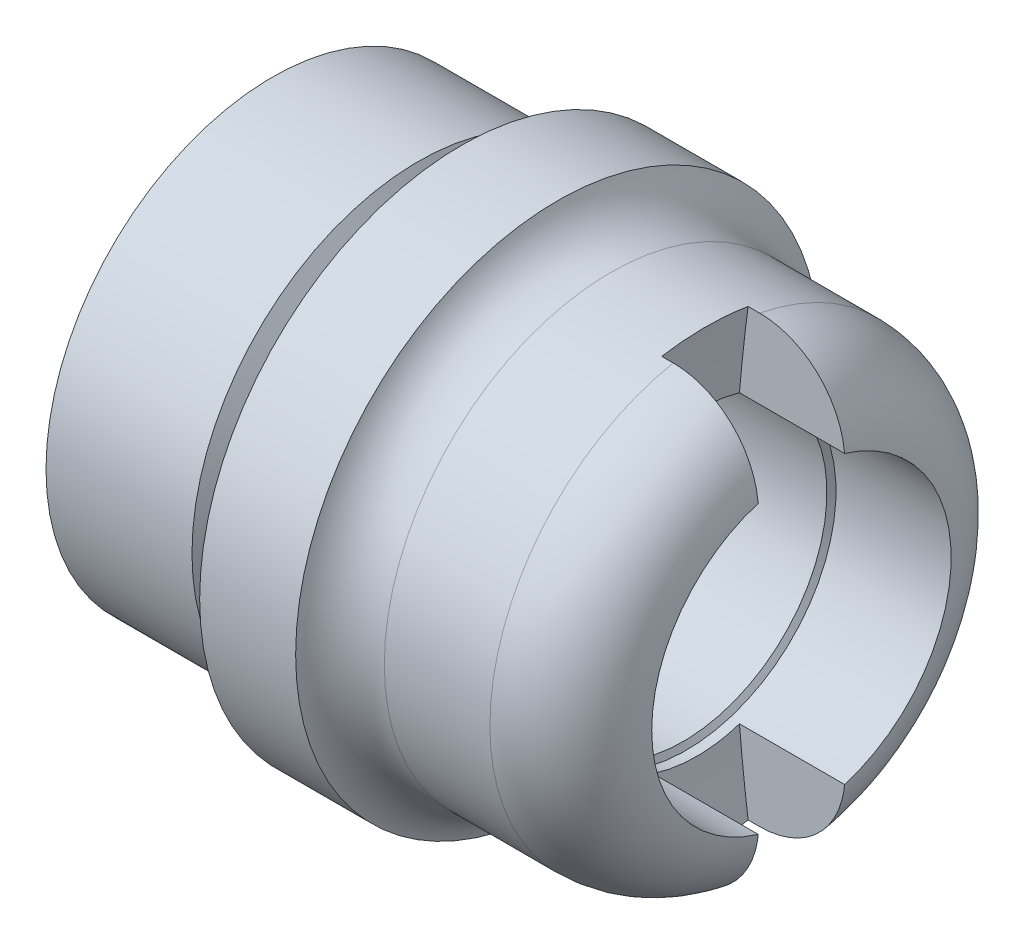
ISO-10303-21;
HEADER;
FILE_DESCRIPTION(('STEP AP214'),'2;1');
FILE_NAME('part.step','',(''),(''),'','','');
FILE_SCHEMA(('AUTOMOTIVE_DESIGN { 1 0 10303 214 1 1 1 1 }'));
ENDSEC;
DATA;
#1=APPLICATION_CONTEXT('core data for automotive mechanical design processes');
#2=APPLICATION_PROTOCOL_DEFINITION('international standard','automotive_design',2000,#1);
#3=PRODUCT_CONTEXT('',#1,'mechanical');
#4=PRODUCT('Part','Part','',(#3));
#5=PRODUCT_RELATED_PRODUCT_CATEGORY('part','',(#4));
#6=PRODUCT_DEFINITION_FORMATION('','',#4);
#7=PRODUCT_DEFINITION_CONTEXT('part definition',#1,'design');
#8=PRODUCT_DEFINITION('design','',#6,#7);
#9=PRODUCT_DEFINITION_SHAPE('','',#8);
#10=(LENGTH_UNIT() NAMED_UNIT(*) SI_UNIT(.MILLI.,.METRE.));
#11=(NAMED_UNIT(*) PLANE_ANGLE_UNIT() SI_UNIT($,.RADIAN.));
#12=(NAMED_UNIT(*) SI_UNIT($,.STERADIAN.) SOLID_ANGLE_UNIT());
#13=UNCERTAINTY_MEASURE_WITH_UNIT(LENGTH_MEASURE(1.E-05),#10,'distance_accuracy_value','');
#14=(GEOMETRIC_REPRESENTATION_CONTEXT(3) GLOBAL_UNCERTAINTY_ASSIGNED_CONTEXT((#13)) GLOBAL_UNIT_ASSIGNED_CONTEXT((#10,
#11,#12)) REPRESENTATION_CONTEXT('',''));
#15=CARTESIAN_POINT('',(0.,0.,0.));
#16=DIRECTION('',(0.,0.,1.));
#17=DIRECTION('',(1.,0.,0.));
#18=AXIS2_PLACEMENT_3D('',#15,#16,#17);
#19=CARTESIAN_POINT('',(5.96158464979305,0.,0.));
#20=DIRECTION('',(-1.,0.,0.));
#21=DIRECTION('',(0.,0.,1.));
#22=AXIS2_PLACEMENT_3D('',#19,#20,#21);
#23=TOROIDAL_SURFACE('',#22,1.86633605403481,1.13086394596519);
#24=CARTESIAN_POINT('',(5.96158464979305,0.,0.));
#25=DIRECTION('',(-1.,0.,0.));
#26=DIRECTION('',(0.,0.,1.));
#27=AXIS2_PLACEMENT_3D('',#24,#25,#26);
#28=CIRCLE('',#27,2.9972);
#29=CARTESIAN_POINT('',(5.96158464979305,-2.94220930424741,0.5715));
#30=VERTEX_POINT('',#29);
#31=CARTESIAN_POINT('',(5.96158464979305,2.94220930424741,0.5715));
#32=VERTEX_POINT('',#31);
#33=EDGE_CURVE('E225',#30,#32,#28,.T.);
#34=ORIENTED_EDGE('',*,*,#33,.F.);
#35=CARTESIAN_POINT('',(6.60490730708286,-2.73736211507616,0.5715));
#36=CARTESIAN_POINT('',(6.65740369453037,-2.70026409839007,0.5715));
#37=CARTESIAN_POINT('',(6.70673498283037,-2.65864123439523,0.5715));
#38=CARTESIAN_POINT('',(6.79766661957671,-2.56763470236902,0.5715));
#39=CARTESIAN_POINT('',(6.83926126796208,-2.51824536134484,0.5715));
#40=CARTESIAN_POINT('',(6.91356117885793,-2.41328029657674,0.5715));
#41=CARTESIAN_POINT('',(6.94627768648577,-2.35771252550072,0.5715));
#42=CARTESIAN_POINT('',(7.00212309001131,-2.24197316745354,0.5715));
#43=CARTESIAN_POINT('',(7.02525311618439,-2.18180212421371,0.5715));
#44=CARTESIAN_POINT('',(7.06188518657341,-2.05723977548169,0.5715));
#45=CARTESIAN_POINT('',(7.07517652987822,-1.99278665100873,0.5715));
#46=CARTESIAN_POINT('',(7.09123638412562,-1.86258858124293,0.5715));
#47=CARTESIAN_POINT('',(7.09400273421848,-1.79684337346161,0.5715));
#48=CARTESIAN_POINT('',(7.08914140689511,-1.66283217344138,0.5715));
#49=CARTESIAN_POINT('',(7.08104835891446,-1.59458337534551,0.5715));
#50=CARTESIAN_POINT('',(7.05425622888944,-1.46022455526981,0.5715));
#51=CARTESIAN_POINT('',(7.03555620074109,-1.39411472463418,0.5715));
#52=CARTESIAN_POINT('',(6.98683259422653,-1.26114709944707,0.5715));
#53=CARTESIAN_POINT('',(6.95613210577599,-1.19453796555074,0.5715));
#54=CARTESIAN_POINT('',(6.88486315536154,-1.06678061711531,0.5715));
#55=CARTESIAN_POINT('',(6.84428512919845,-1.00563777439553,0.5715));
#56=CARTESIAN_POINT('',(6.75049434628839,-0.88481966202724,0.5715));
#57=CARTESIAN_POINT('',(6.69647249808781,-0.825773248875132,0.5715));
#58=CARTESIAN_POINT('',(6.57955646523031,-0.717140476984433,0.5715));
#59=CARTESIAN_POINT('',(6.51666494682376,-0.667551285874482,0.5715));
#60=CARTESIAN_POINT('',(6.40625483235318,-0.595921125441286,0.5715));
#61=CARTESIAN_POINT('',(6.3610459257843,-0.570309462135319,0.5715));
#62=CARTESIAN_POINT('',(6.2674060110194,-0.525922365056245,0.5715));
#63=CARTESIAN_POINT('',(6.21898324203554,-0.507130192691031,0.5715));
#64=CARTESIAN_POINT('',(6.12894548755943,-0.48139288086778,0.5715));
#65=CARTESIAN_POINT('',(6.08779161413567,-0.472872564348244,0.5715));
#66=CARTESIAN_POINT('',(6.00465787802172,-0.463039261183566,0.5715));
#67=CARTESIAN_POINT('',(5.96267953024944,-0.461714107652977,0.5715));
#68=CARTESIAN_POINT('',(5.87919837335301,-0.46647186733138,0.5715));
#69=CARTESIAN_POINT('',(5.83769521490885,-0.472548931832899,0.5715));
#70=CARTESIAN_POINT('',(5.75612309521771,-0.491159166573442,0.5715));
#71=CARTESIAN_POINT('',(5.71605790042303,-0.503708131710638,0.5715));
#72=CARTESIAN_POINT('',(5.61756424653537,-0.541793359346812,0.5715));
#73=CARTESIAN_POINT('',(5.56044924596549,-0.570689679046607,0.5715));
#74=CARTESIAN_POINT('',(5.45129481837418,-0.636860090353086,0.5715));
#75=CARTESIAN_POINT('',(5.39926920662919,-0.674156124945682,0.5715));
#76=CARTESIAN_POINT('',(5.2862639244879,-0.76719844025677,0.5715));
#77=CARTESIAN_POINT('',(5.22709213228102,-0.825154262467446,0.5715));
#78=CARTESIAN_POINT('',(5.11919190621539,-0.949991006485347,0.5715));
#79=CARTESIAN_POINT('',(5.07045687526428,-1.01686624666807,0.5715));
#80=CARTESIAN_POINT('',(4.98510208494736,-1.15803538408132,0.5715));
#81=CARTESIAN_POINT('',(4.94848714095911,-1.23233221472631,0.5715));
#82=CARTESIAN_POINT('',(4.88924720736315,-1.38633062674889,0.5715));
#83=CARTESIAN_POINT('',(4.86661662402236,-1.46603003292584,0.5715));
#84=CARTESIAN_POINT('',(4.83782303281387,-1.62300880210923,0.5715));
#85=CARTESIAN_POINT('',(4.83068447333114,-1.70010828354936,0.5715));
#86=CARTESIAN_POINT('',(4.83075715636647,-1.85431150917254,0.5715));
#87=CARTESIAN_POINT('',(4.83796153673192,-1.93141523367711,0.5715));
#88=CARTESIAN_POINT('',(4.86566735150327,-2.07630043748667,0.5715));
#89=CARTESIAN_POINT('',(4.88496858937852,-2.14431245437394,0.5715));
#90=CARTESIAN_POINT('',(4.93539444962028,-2.27580431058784,0.5715));
#91=CARTESIAN_POINT('',(4.96651457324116,-2.33928586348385,0.5715));
#92=CARTESIAN_POINT('',(5.03769971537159,-2.45614611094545,0.5715));
#93=CARTESIAN_POINT('',(5.0771621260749,-2.50989246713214,0.5715));
#94=CARTESIAN_POINT('',(5.16483343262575,-2.60970481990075,0.5715));
#95=CARTESIAN_POINT('',(5.21304050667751,-2.65577241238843,0.5715));
#96=CARTESIAN_POINT('',(5.31507893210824,-2.73734804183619,0.5715));
#97=CARTESIAN_POINT('',(5.36867167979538,-2.77315480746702,0.5715));
#98=CARTESIAN_POINT('',(5.48119566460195,-2.83506407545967,0.5715));
#99=CARTESIAN_POINT('',(5.54012619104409,-2.86116786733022,0.5715));
#100=CARTESIAN_POINT('',(5.66047325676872,-2.90246178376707,0.5715));
#101=CARTESIAN_POINT('',(5.72182369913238,-2.91784474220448,0.5715));
#102=CARTESIAN_POINT('',(5.84625145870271,-2.93799804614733,0.5715));
#103=CARTESIAN_POINT('',(5.90932888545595,-2.94276771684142,0.5715));
#104=CARTESIAN_POINT('',(6.03486569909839,-2.94155138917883,0.5715));
#105=CARTESIAN_POINT('',(6.09732596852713,-2.93565180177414,0.5715));
#106=CARTESIAN_POINT('',(6.22033852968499,-2.91344488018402,0.5715));
#107=CARTESIAN_POINT('',(6.2808920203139,-2.89714422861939,0.5715));
#108=CARTESIAN_POINT('',(6.38668885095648,-2.85888720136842,0.5715));
#109=CARTESIAN_POINT('',(6.43258168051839,-2.83870080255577,0.5715));
#110=CARTESIAN_POINT('',(6.52125816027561,-2.79237773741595,0.5715));
#111=CARTESIAN_POINT('',(6.56404172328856,-2.76624090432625,0.5715));
#112=CARTESIAN_POINT('',(6.60490730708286,-2.73736211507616,0.5715));
#113=B_SPLINE_CURVE_WITH_KNOTS('',3,(#35,#36,#37,#38,#39,#40,#41,#42,#43,#44,#45,#46,#47,#48,
#49,#50,#51,#52,#53,#54,#55,#56,#57,#58,#59,#60,#61,#62,#63,#64,#65,#66,#67,#68,#69,#70,#71,#72,
#73,#74,#75,#76,#77,#78,#79,#80,#81,#82,#83,#84,#85,#86,#87,#88,#89,#90,#91,#92,#93,#94,#95,#96,
#97,#98,#99,#100,#101,#102,#103,#104,#105,#106,#107,#108,#109,#110,#111,#112),.UNSPECIFIED.,.T.,
.F.,(4,2,2,2,2,2,2,2,2,2,2,2,2,2,2,2,2,2,2,2,2,2,2,2,2,2,2,2,2,2,2,2,2,2,2,2,2,2,4),(0.,
0.192660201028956,0.385461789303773,0.578018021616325,0.770551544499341,0.967097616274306,
1.16368403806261,1.36896974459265,1.57427376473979,1.79338385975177,2.01270696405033,
2.25179582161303,2.49081296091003,2.64629100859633,2.8013848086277,2.92692364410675,
3.05225012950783,3.17747765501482,3.30301225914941,3.49397927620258,3.68545107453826,
3.93271228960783,4.17981674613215,4.42701926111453,4.67412283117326,4.9051505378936,
5.13606773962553,5.34707259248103,5.55799720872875,5.75704051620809,5.95604240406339,
6.14846582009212,6.34086365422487,6.52970473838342,6.71855782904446,6.90588823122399,
7.09309839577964,7.2430696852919,7.39304517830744),.UNSPECIFIED.);
#114=CARTESIAN_POINT('',(7.0866,-1.8969821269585,0.5715));
#115=VERTEX_POINT('',#114);
#116=EDGE_CURVE('E59',#30,#115,#113,.T.);
#117=ORIENTED_EDGE('',*,*,#116,.T.);
#118=CARTESIAN_POINT('',(7.0866,0.,0.));
#119=DIRECTION('',(-1.,0.,0.));
#120=DIRECTION('',(0.,0.,1.));
#121=AXIS2_PLACEMENT_3D('',#118,#119,#120);
#122=CIRCLE('',#121,1.9812);
#123=CARTESIAN_POINT('',(7.0866,1.8969821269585,0.5715));
#124=VERTEX_POINT('',#123);
#125=EDGE_CURVE('E218',#115,#124,#122,.T.);
#126=ORIENTED_EDGE('',*,*,#125,.T.);
#127=CARTESIAN_POINT('',(6.05835311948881,0.469494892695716,0.5715));
#128=CARTESIAN_POINT('',(6.11595320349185,0.477301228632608,0.5715));
#129=CARTESIAN_POINT('',(6.17266652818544,0.491970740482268,0.5715));
#130=CARTESIAN_POINT('',(6.28244565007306,0.531698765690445,0.5715));
#131=CARTESIAN_POINT('',(6.33548589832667,0.556822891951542,0.5715));
#132=CARTESIAN_POINT('',(6.45201686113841,0.622825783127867,0.5715));
#133=CARTESIAN_POINT('',(6.5141018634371,0.666158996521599,0.5715));
#134=CARTESIAN_POINT('',(6.6305811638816,0.761922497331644,0.5715));
#135=CARTESIAN_POINT('',(6.68498150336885,0.814345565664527,0.5715));
#136=CARTESIAN_POINT('',(6.78665840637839,0.928409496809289,0.5715));
#137=CARTESIAN_POINT('',(6.8336917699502,0.990268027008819,0.5715));
#138=CARTESIAN_POINT('',(6.91727698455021,1.1206957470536,0.5715));
#139=CARTESIAN_POINT('',(6.95383216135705,1.18926279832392,0.5715));
#140=CARTESIAN_POINT('',(7.01650646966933,1.33518359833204,0.5715));
#141=CARTESIAN_POINT('',(7.04200726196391,1.41280595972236,0.5715));
#142=CARTESIAN_POINT('',(7.07821599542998,1.57146670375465,0.5715));
#143=CARTESIAN_POINT('',(7.08892642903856,1.65250450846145,0.5715));
#144=CARTESIAN_POINT('',(7.09425521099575,1.80795149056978,0.5715));
#145=CARTESIAN_POINT('',(7.09020931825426,1.882315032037,0.5715));
#146=CARTESIAN_POINT('',(7.0686371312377,2.02905901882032,0.5715));
#147=CARTESIAN_POINT('',(7.05111833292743,2.10144054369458,0.5715));
#148=CARTESIAN_POINT('',(7.0046815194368,2.23638264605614,0.5715));
#149=CARTESIAN_POINT('',(6.97671793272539,2.2992725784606,0.5715));
#150=CARTESIAN_POINT('',(6.91013760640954,2.41913879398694,0.5715));
#151=CARTESIAN_POINT('',(6.87152387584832,2.47611674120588,0.5715));
#152=CARTESIAN_POINT('',(6.78672036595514,2.57980566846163,0.5715));
#153=CARTESIAN_POINT('',(6.74095926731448,2.62686767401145,0.5715));
#154=CARTESIAN_POINT('',(6.64199684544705,2.71238293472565,0.5715));
#155=CARTESIAN_POINT('',(6.58879678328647,2.7508376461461,0.5715));
#156=CARTESIAN_POINT('',(6.47800872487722,2.8170090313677,0.5715));
#157=CARTESIAN_POINT('',(6.42057458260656,2.84498351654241,0.5715));
#158=CARTESIAN_POINT('',(6.30177910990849,2.89073568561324,0.5715));
#159=CARTESIAN_POINT('',(6.24041813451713,2.90851428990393,0.5715));
#160=CARTESIAN_POINT('',(6.1164422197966,2.93314438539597,0.5715));
#161=CARTESIAN_POINT('',(6.05385711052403,2.94014623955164,0.5715));
#162=CARTESIAN_POINT('',(5.92840403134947,2.94348586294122,0.5715));
#163=CARTESIAN_POINT('',(5.86553607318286,2.93982407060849,0.5715));
#164=CARTESIAN_POINT('',(5.74162860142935,2.9219937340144,0.5715));
#165=CARTESIAN_POINT('',(5.68058157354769,2.90787732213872,0.5715));
#166=CARTESIAN_POINT('',(5.56171403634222,2.8696252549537,0.5715));
#167=CARTESIAN_POINT('',(5.50389351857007,2.84548962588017,0.5715));
#168=CARTESIAN_POINT('',(5.39291791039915,2.78783584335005,0.5715));
#169=CARTESIAN_POINT('',(5.33977739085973,2.7542896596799,0.5715));
#170=CARTESIAN_POINT('',(5.23980367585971,2.6788453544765,0.5715));
#171=CARTESIAN_POINT('',(5.19297068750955,2.63694695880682,0.5715));
#172=CARTESIAN_POINT('',(5.10634343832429,2.54550407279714,0.5715));
#173=CARTESIAN_POINT('',(5.06663540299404,2.49587794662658,0.5715));
#174=CARTESIAN_POINT('',(4.99591152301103,2.39078303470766,0.5715));
#175=CARTESIAN_POINT('',(4.96489632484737,2.33531381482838,0.5715));
#176=CARTESIAN_POINT('',(4.91167293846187,2.21884067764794,0.5715));
#177=CARTESIAN_POINT('',(4.88967100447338,2.15774261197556,0.5715));
#178=CARTESIAN_POINT('',(4.85585096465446,2.0327992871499,0.5715));
#179=CARTESIAN_POINT('',(4.84403404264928,1.96895370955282,0.5715));
#180=CARTESIAN_POINT('',(4.83039632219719,1.83788437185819,0.5715));
#181=CARTESIAN_POINT('',(4.8289509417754,1.7706217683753,0.5715));
#182=CARTESIAN_POINT('',(4.83674859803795,1.63672911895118,0.5715));
#183=CARTESIAN_POINT('',(4.84599404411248,1.57009921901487,0.5715));
#184=CARTESIAN_POINT('',(4.87537808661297,1.43534513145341,0.5715));
#185=CARTESIAN_POINT('',(4.89610255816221,1.36734917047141,0.5715));
#186=CARTESIAN_POINT('',(4.94781231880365,1.23539758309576,0.5715));
#187=CARTESIAN_POINT('',(4.97879989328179,1.1714428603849,0.5715));
#188=CARTESIAN_POINT('',(5.05279966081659,1.04381364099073,0.5715));
#189=CARTESIAN_POINT('',(5.09658820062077,0.980590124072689,0.5715));
#190=CARTESIAN_POINT('',(5.19344833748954,0.861595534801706,0.5715));
#191=CARTESIAN_POINT('',(5.24652989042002,0.805832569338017,0.5715));
#192=CARTESIAN_POINT('',(5.35315595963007,0.710141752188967,0.5715));
#193=CARTESIAN_POINT('',(5.40569947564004,0.669094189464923,0.5715));
#194=CARTESIAN_POINT('',(5.51642187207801,0.595425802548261,0.5715));
#195=CARTESIAN_POINT('',(5.57459003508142,0.562789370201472,0.5715));
#196=CARTESIAN_POINT('',(5.67607679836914,0.518110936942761,0.5715));
#197=CARTESIAN_POINT('',(5.71795566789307,0.502827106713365,0.5715));
#198=CARTESIAN_POINT('',(5.80357998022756,0.47914545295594,0.5715));
#199=CARTESIAN_POINT('',(5.84731925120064,0.470726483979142,0.5715));
#200=CARTESIAN_POINT('',(5.91920087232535,0.463652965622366,0.5715));
#201=CARTESIAN_POINT('',(5.94711215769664,0.462535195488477,0.5715));
#202=CARTESIAN_POINT('',(6.00286806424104,0.46358327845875,0.5715));
#203=CARTESIAN_POINT('',(6.0307126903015,0.465748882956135,0.5715));
#204=CARTESIAN_POINT('',(6.05835311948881,0.469494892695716,0.5715));
#205=B_SPLINE_CURVE_WITH_KNOTS('',3,(#127,#128,#129,#130,#131,#132,#133,#134,#135,#136,#137,
#138,#139,#140,#141,#142,#143,#144,#145,#146,#147,#148,#149,#150,#151,#152,#153,#154,#155,#156,
#157,#158,#159,#160,#161,#162,#163,#164,#165,#166,#167,#168,#169,#170,#171,#172,#173,#174,#175,
#176,#177,#178,#179,#180,#181,#182,#183,#184,#185,#186,#187,#188,#189,#190,#191,#192,#193,#194,
#195,#196,#197,#198,#199,#200,#201,#202,#203,#204),.UNSPECIFIED.,.T.,.F.,(4,2,2,2,2,2,2,2,2,2,2,
2,2,2,2,2,2,2,2,2,2,2,2,2,2,2,2,2,2,2,2,2,2,2,2,2,2,2,4),(0.,0.174235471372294,
0.349581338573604,0.575566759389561,0.801373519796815,1.0335269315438,1.2656065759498,
1.50937492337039,1.7531021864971,1.97533689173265,2.19744804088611,2.40288590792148,
2.60826579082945,2.80422634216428,3.00015371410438,3.19088319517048,3.38159545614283,
3.56962187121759,3.75764055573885,3.94472793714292,4.13181482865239,4.31946500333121,
4.50712133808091,4.69691458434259,4.88672194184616,5.08065816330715,5.27461692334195,
5.47556254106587,5.67655345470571,5.88889884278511,6.10129154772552,6.33106036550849,
6.56107686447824,6.76049381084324,6.95953799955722,7.09285050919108,7.22575081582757,
7.30936714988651,7.39297715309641),.UNSPECIFIED.);
#206=EDGE_CURVE('E102',#124,#32,#205,.T.);
#207=ORIENTED_EDGE('',*,*,#206,.T.);
#208=EDGE_LOOP('',(#34,#117,#126,#207));
#209=FACE_BOUND('',#208,.T.);
#210=ADVANCED_FACE('F36',(#209),#23,.T.);
#211=CARTESIAN_POINT('',(2.5908,-4.07378282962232,0.));
#212=DIRECTION('',(1.,0.,0.));
#213=DIRECTION('',(0.,0.,-1.));
#214=AXIS2_PLACEMENT_3D('',#211,#212,#213);
#215=PLANE('',#214);
#216=CARTESIAN_POINT('',(2.5908,0.,0.));
#217=DIRECTION('',(-1.,0.,0.));
#218=DIRECTION('',(0.,0.,1.));
#219=AXIS2_PLACEMENT_3D('',#216,#217,#218);
#220=CIRCLE('',#219,2.8448);
#221=CARTESIAN_POINT('',(2.5908,0.,2.8448));
#222=VERTEX_POINT('',#221);
#223=EDGE_CURVE('E251',#222,#222,#220,.T.);
#224=ORIENTED_EDGE('',*,*,#223,.F.);
#225=EDGE_LOOP('',(#224));
#226=FACE_BOUND('',#225,.T.);
#227=CARTESIAN_POINT('',(2.5908,0.,0.));
#228=DIRECTION('',(-1.,0.,0.));
#229=DIRECTION('',(0.,0.,1.));
#230=AXIS2_PLACEMENT_3D('',#227,#228,#229);
#231=CIRCLE('',#230,3.4671);
#232=CARTESIAN_POINT('',(2.5908,0.,3.4671));
#233=VERTEX_POINT('',#232);
#234=EDGE_CURVE('E124',#233,#233,#231,.T.);
#235=ORIENTED_EDGE('',*,*,#234,.T.);
#236=EDGE_LOOP('',(#235));
#237=FACE_BOUND('',#236,.T.);
#238=ADVANCED_FACE('F38',(#226,#237),#215,.F.);
#239=CARTESIAN_POINT('',(2.413,0.,0.));
#240=DIRECTION('',(-1.,0.,0.));
#241=DIRECTION('',(0.,0.,1.));
#242=AXIS2_PLACEMENT_3D('',#239,#240,#241);
#243=TOROIDAL_SURFACE('',#242,2.8448,0.1778);
#244=CARTESIAN_POINT('',(2.413,0.,0.));
#245=DIRECTION('',(-1.,0.,0.));
#246=DIRECTION('',(0.,0.,1.));
#247=AXIS2_PLACEMENT_3D('',#244,#245,#246);
#248=CIRCLE('',#247,2.667);
#249=CARTESIAN_POINT('',(2.413,0.,2.667));
#250=VERTEX_POINT('',#249);
#251=EDGE_CURVE('E248',#250,#250,#248,.T.);
#252=ORIENTED_EDGE('',*,*,#251,.F.);
#253=EDGE_LOOP('',(#252));
#254=FACE_BOUND('',#253,.T.);
#255=ORIENTED_EDGE('',*,*,#223,.T.);
#256=EDGE_LOOP('',(#255));
#257=FACE_BOUND('',#256,.T.);
#258=ADVANCED_FACE('F284',(#254,#257),#243,.F.);
#259=CARTESIAN_POINT('',(0.,0.,0.));
#260=DIRECTION('',(-1.,0.,0.));
#261=DIRECTION('',(0.,0.,1.));
#262=AXIS2_PLACEMENT_3D('',#259,#260,#261);
#263=CYLINDRICAL_SURFACE('',#262,2.667);
#264=CARTESIAN_POINT('',(2.2098,0.,0.));
#265=DIRECTION('',(-1.,0.,0.));
#266=DIRECTION('',(0.,0.,1.));
#267=AXIS2_PLACEMENT_3D('',#264,#265,#266);
#268=CIRCLE('',#267,2.667);
#269=CARTESIAN_POINT('',(2.2098,0.,2.667));
#270=VERTEX_POINT('',#269);
#271=EDGE_CURVE('E245',#270,#270,#268,.T.);
#272=ORIENTED_EDGE('',*,*,#271,.F.);
#273=EDGE_LOOP('',(#272));
#274=FACE_BOUND('',#273,.T.);
#275=ORIENTED_EDGE('',*,*,#251,.T.);
#276=EDGE_LOOP('',(#275));
#277=FACE_BOUND('',#276,.T.);
#278=ADVANCED_FACE('F289',(#274,#277),#263,.T.);
#279=CARTESIAN_POINT('',(2.2098,0.,0.));
#280=DIRECTION('',(-1.,0.,0.));
#281=DIRECTION('',(0.,0.,1.));
#282=AXIS2_PLACEMENT_3D('',#279,#280,#281);
#283=CONICAL_SURFACE('',#282,2.667,1.04719755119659);
#284=CARTESIAN_POINT('',(2.01915894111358,0.,0.));
#285=DIRECTION('',(-1.,0.,0.));
#286=DIRECTION('',(0.,0.,1.));
#287=AXIS2_PLACEMENT_3D('',#284,#285,#286);
#288=CIRCLE('',#287,2.9972);
#289=CARTESIAN_POINT('',(2.01915894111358,0.,2.9972));
#290=VERTEX_POINT('',#289);
#291=EDGE_CURVE('E242',#290,#290,#288,.T.);
#292=ORIENTED_EDGE('',*,*,#291,.F.);
#293=EDGE_LOOP('',(#292));
#294=FACE_BOUND('',#293,.T.);
#295=ORIENTED_EDGE('',*,*,#271,.T.);
#296=EDGE_LOOP('',(#295));
#297=FACE_BOUND('',#296,.T.);
#298=ADVANCED_FACE('F298',(#294,#297),#283,.T.);
#299=CARTESIAN_POINT('',(0.,0.,0.));
#300=DIRECTION('',(-1.,0.,0.));
#301=DIRECTION('',(0.,0.,1.));
#302=AXIS2_PLACEMENT_3D('',#299,#300,#301);
#303=CYLINDRICAL_SURFACE('',#302,2.9972);
#304=CARTESIAN_POINT('',(0.0879881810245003,0.,0.));
#305=DIRECTION('',(-1.,0.,0.));
#306=DIRECTION('',(0.,0.,1.));
#307=AXIS2_PLACEMENT_3D('',#304,#305,#306);
#308=CIRCLE('',#307,2.9972);
#309=CARTESIAN_POINT('',(0.0879881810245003,0.,2.9972));
#310=VERTEX_POINT('',#309);
#311=EDGE_CURVE('E239',#310,#310,#308,.T.);
#312=ORIENTED_EDGE('',*,*,#311,.F.);
#313=EDGE_LOOP('',(#312));
#314=FACE_BOUND('',#313,.T.);
#315=ORIENTED_EDGE('',*,*,#291,.T.);
#316=EDGE_LOOP('',(#315));
#317=FACE_BOUND('',#316,.T.);
#318=ADVANCED_FACE('F305',(#314,#317),#303,.T.);
#319=CARTESIAN_POINT('',(0.0879881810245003,0.,0.));
#320=DIRECTION('',(1.,0.,0.));
#321=DIRECTION('',(0.,0.,-1.));
#322=AXIS2_PLACEMENT_3D('',#319,#320,#321);
#323=CONICAL_SURFACE('',#322,2.9972,1.04719755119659);
#324=CARTESIAN_POINT('',(0.,0.,0.));
#325=DIRECTION('',(-1.,0.,0.));
#326=DIRECTION('',(0.,0.,1.));
#327=AXIS2_PLACEMENT_3D('',#324,#325,#326);
#328=CIRCLE('',#327,2.8448);
#329=CARTESIAN_POINT('',(0.,0.,2.8448));
#330=VERTEX_POINT('',#329);
#331=EDGE_CURVE('E236',#330,#330,#328,.T.);
#332=ORIENTED_EDGE('',*,*,#331,.F.);
#333=EDGE_LOOP('',(#332));
#334=FACE_BOUND('',#333,.T.);
#335=ORIENTED_EDGE('',*,*,#311,.T.);
#336=EDGE_LOOP('',(#335));
#337=FACE_BOUND('',#336,.T.);
#338=ADVANCED_FACE('F309',(#334,#337),#323,.T.);
#339=CARTESIAN_POINT('',(0.,-4.07378282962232,0.));
#340=DIRECTION('',(1.,0.,0.));
#341=DIRECTION('',(0.,0.,-1.));
#342=AXIS2_PLACEMENT_3D('',#339,#340,#341);
#343=PLANE('',#342);
#344=CARTESIAN_POINT('',(0.,0.,0.));
#345=DIRECTION('',(-1.,0.,0.));
#346=DIRECTION('',(0.,0.,1.));
#347=AXIS2_PLACEMENT_3D('',#344,#345,#346);
#348=CIRCLE('',#347,2.667);
#349=CARTESIAN_POINT('',(0.,0.,2.667));
#350=VERTEX_POINT('',#349);
#351=EDGE_CURVE('E233',#350,#350,#348,.T.);
#352=ORIENTED_EDGE('',*,*,#351,.F.);
#353=EDGE_LOOP('',(#352));
#354=FACE_BOUND('',#353,.T.);
#355=ORIENTED_EDGE('',*,*,#331,.T.);
#356=EDGE_LOOP('',(#355));
#357=FACE_BOUND('',#356,.T.);
#358=ADVANCED_FACE('F313',(#354,#357),#343,.F.);
#359=CARTESIAN_POINT('',(0.,0.,0.));
#360=DIRECTION('',(-1.,0.,0.));
#361=DIRECTION('',(0.,0.,1.));
#362=AXIS2_PLACEMENT_3D('',#359,#360,#361);
#363=CONICAL_SURFACE('',#362,2.667,0.785398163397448);
#364=CARTESIAN_POINT('',(0.762000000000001,0.,0.));
#365=DIRECTION('',(-1.,0.,0.));
#366=DIRECTION('',(0.,0.,1.));
#367=AXIS2_PLACEMENT_3D('',#364,#365,#366);
#368=CIRCLE('',#367,1.905);
#369=CARTESIAN_POINT('',(0.762000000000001,0.,1.905));
#370=VERTEX_POINT('',#369);
#371=EDGE_CURVE('E230',#370,#370,#368,.T.);
#372=ORIENTED_EDGE('',*,*,#371,.F.);
#373=EDGE_LOOP('',(#372));
#374=FACE_BOUND('',#373,.T.);
#375=ORIENTED_EDGE('',*,*,#351,.T.);
#376=EDGE_LOOP('',(#375));
#377=FACE_BOUND('',#376,.T.);
#378=ADVANCED_FACE('F317',(#374,#377),#363,.F.);
#379=CARTESIAN_POINT('',(0.,0.,0.));
#380=DIRECTION('',(-1.,0.,0.));
#381=DIRECTION('',(0.,0.,1.));
#382=AXIS2_PLACEMENT_3D('',#379,#380,#381);
#383=CYLINDRICAL_SURFACE('',#382,1.905);
#384=CARTESIAN_POINT('',(5.51860590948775,0.,0.));
#385=DIRECTION('',(-1.,0.,0.));
#386=DIRECTION('',(0.,0.,1.));
#387=AXIS2_PLACEMENT_3D('',#384,#385,#386);
#388=CIRCLE('',#387,1.905);
#389=CARTESIAN_POINT('',(5.51860590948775,0.,1.905));
#390=VERTEX_POINT('',#389);
#391=EDGE_CURVE('E221',#390,#390,#388,.T.);
#392=ORIENTED_EDGE('',*,*,#391,.F.);
#393=EDGE_LOOP('',(#392));
#394=FACE_BOUND('',#393,.T.);
#395=ORIENTED_EDGE('',*,*,#371,.T.);
#396=EDGE_LOOP('',(#395));
#397=FACE_BOUND('',#396,.T.);
#398=ADVANCED_FACE('F321',(#394,#397),#383,.F.);
#399=CARTESIAN_POINT('',(5.51860590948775,0.,0.));
#400=DIRECTION('',(1.,0.,0.));
#401=DIRECTION('',(0.,0.,-1.));
#402=AXIS2_PLACEMENT_3D('',#399,#400,#401);
#403=CONICAL_SURFACE('',#402,1.905,1.04719755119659);
#404=CARTESIAN_POINT('',(5.5626,0.,0.));
#405=DIRECTION('',(-1.,0.,0.));
#406=DIRECTION('',(0.,0.,1.));
#407=AXIS2_PLACEMENT_3D('',#404,#405,#406);
#408=CIRCLE('',#407,1.9812);
#409=CARTESIAN_POINT('',(5.5626,0.,1.9812));
#410=VERTEX_POINT('',#409);
#411=EDGE_CURVE('E217',#410,#410,#408,.T.);
#412=ORIENTED_EDGE('',*,*,#411,.F.);
#413=EDGE_LOOP('',(#412));
#414=FACE_BOUND('',#413,.T.);
#415=ORIENTED_EDGE('',*,*,#391,.T.);
#416=EDGE_LOOP('',(#415));
#417=FACE_BOUND('',#416,.T.);
#418=ADVANCED_FACE('F324',(#414,#417),#403,.F.);
#419=CARTESIAN_POINT('',(0.,0.,0.));
#420=DIRECTION('',(-1.,0.,0.));
#421=DIRECTION('',(0.,0.,1.));
#422=AXIS2_PLACEMENT_3D('',#419,#420,#421);
#423=CYLINDRICAL_SURFACE('',#422,1.9812);
#424=CARTESIAN_POINT('',(5.69468082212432,-1.8969821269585,0.5715));
#425=CARTESIAN_POINT('',(5.69607039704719,-1.91319009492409,0.517696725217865));
#426=CARTESIAN_POINT('',(5.69727887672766,-1.92710210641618,0.463229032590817));
#427=CARTESIAN_POINT('',(5.6993058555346,-1.95025547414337,0.353295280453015));
#428=CARTESIAN_POINT('',(5.70012430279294,-1.95949620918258,0.297829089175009));
#429=CARTESIAN_POINT('',(5.70192185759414,-1.97974362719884,0.133247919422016));
#430=CARTESIAN_POINT('',(5.70231514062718,-1.9840904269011,0.0232175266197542));
#431=CARTESIAN_POINT('',(5.70157128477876,-1.97577032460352,-0.16777261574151));
#432=CARTESIAN_POINT('',(5.7008008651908,-1.96718190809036,-0.248948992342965));
#433=CARTESIAN_POINT('',(5.69839296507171,-1.93985751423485,-0.411095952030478));
#434=CARTESIAN_POINT('',(5.69673983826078,-1.92093827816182,-0.492035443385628));
#435=CARTESIAN_POINT('',(5.69468082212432,-1.8969821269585,-0.5715));
#436=B_SPLINE_CURVE_WITH_KNOTS('',3,(#424,#425,#426,#427,#428,#429,#430,#431,#432,#433,#434,
#435),.UNSPECIFIED.,.F.,.F.,(4,2,2,2,2,4),(0.,0.168514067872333,0.337050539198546,
0.665672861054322,0.909993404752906,1.15879581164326),.UNSPECIFIED.);
#437=CARTESIAN_POINT('',(5.69468082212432,-1.8969821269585,0.5715));
#438=VERTEX_POINT('',#437);
#439=CARTESIAN_POINT('',(5.69468082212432,-1.8969821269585,-0.5715));
#440=VERTEX_POINT('',#439);
#441=EDGE_CURVE('E125',#438,#440,#436,.T.);
#442=ORIENTED_EDGE('',*,*,#441,.T.);
#443=DIRECTION('',(-1.,0.,0.));
#444=VECTOR('',#443,1.);
#445=CARTESIAN_POINT('',(0.,-1.8969821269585,-0.5715));
#446=LINE('',#445,#444);
#447=CARTESIAN_POINT('',(7.0866,-1.8969821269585,-0.5715));
#448=VERTEX_POINT('',#447);
#449=EDGE_CURVE('E130',#440,#448,#446,.F.);
#450=ORIENTED_EDGE('',*,*,#449,.T.);
#451=CARTESIAN_POINT('',(7.0866,1.8969821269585,-0.5715));
#452=VERTEX_POINT('',#451);
#453=EDGE_CURVE('E209',#452,#448,#122,.T.);
#454=ORIENTED_EDGE('',*,*,#453,.F.);
#455=DIRECTION('',(-1.,0.,0.));
#456=VECTOR('',#455,1.);
#457=CARTESIAN_POINT('',(0.,1.8969821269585,-0.5715));
#458=LINE('',#457,#456);
#459=CARTESIAN_POINT('',(5.69468082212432,1.8969821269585,-0.5715));
#460=VERTEX_POINT('',#459);
#461=EDGE_CURVE('E123',#452,#460,#458,.T.);
#462=ORIENTED_EDGE('',*,*,#461,.T.);
#463=CARTESIAN_POINT('',(5.69468082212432,1.8969821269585,-0.5715));
#464=CARTESIAN_POINT('',(5.69607039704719,1.91319009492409,-0.517696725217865));
#465=CARTESIAN_POINT('',(5.69727887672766,1.92710210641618,-0.463229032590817));
#466=CARTESIAN_POINT('',(5.6993058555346,1.95025547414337,-0.353295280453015));
#467=CARTESIAN_POINT('',(5.70012430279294,1.95949620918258,-0.297829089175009));
#468=CARTESIAN_POINT('',(5.70192185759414,1.97974362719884,-0.133247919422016));
#469=CARTESIAN_POINT('',(5.70231514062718,1.9840904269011,-0.0232175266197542));
#470=CARTESIAN_POINT('',(5.70157128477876,1.97577032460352,0.16777261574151));
#471=CARTESIAN_POINT('',(5.7008008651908,1.96718190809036,0.248948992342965));
#472=CARTESIAN_POINT('',(5.69839296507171,1.93985751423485,0.411095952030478));
#473=CARTESIAN_POINT('',(5.69673983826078,1.92093827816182,0.492035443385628));
#474=CARTESIAN_POINT('',(5.69468082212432,1.8969821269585,0.5715));
#475=B_SPLINE_CURVE_WITH_KNOTS('',3,(#463,#464,#465,#466,#467,#468,#469,#470,#471,#472,#473,
#474),.UNSPECIFIED.,.F.,.F.,(4,2,2,2,2,4),(0.,0.168514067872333,0.337050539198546,
0.665672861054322,0.909993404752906,1.15879581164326),.UNSPECIFIED.);
#476=CARTESIAN_POINT('',(5.69468082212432,1.8969821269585,0.5715));
#477=VERTEX_POINT('',#476);
#478=EDGE_CURVE('E111',#460,#477,#475,.T.);
#479=ORIENTED_EDGE('',*,*,#478,.T.);
#480=DIRECTION('',(-1.,0.,0.));
#481=VECTOR('',#480,1.);
#482=CARTESIAN_POINT('',(0.,1.8969821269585,0.5715));
#483=LINE('',#482,#481);
#484=EDGE_CURVE('E99',#124,#477,#483,.T.);
#485=ORIENTED_EDGE('',*,*,#484,.F.);
#486=ORIENTED_EDGE('',*,*,#125,.F.);
#487=DIRECTION('',(-1.,0.,0.));
#488=VECTOR('',#487,1.);
#489=CARTESIAN_POINT('',(0.,-1.8969821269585,0.5715));
#490=LINE('',#489,#488);
#491=EDGE_CURVE('E198',#438,#115,#490,.F.);
#492=ORIENTED_EDGE('',*,*,#491,.F.);
#493=EDGE_LOOP('',(#442,#450,#454,#462,#479,#485,#486,#492));
#494=FACE_BOUND('',#493,.T.);
#495=ORIENTED_EDGE('',*,*,#411,.T.);
#496=EDGE_LOOP('',(#495));
#497=FACE_BOUND('',#496,.T.);
#498=ADVANCED_FACE('F120',(#494,#497),#423,.F.);
#499=CARTESIAN_POINT('',(6.60490730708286,-2.73736211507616,-0.5715));
#500=CARTESIAN_POINT('',(6.65740369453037,-2.70026409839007,-0.5715));
#501=CARTESIAN_POINT('',(6.70673498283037,-2.65864123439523,-0.5715));
#502=CARTESIAN_POINT('',(6.79766661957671,-2.56763470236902,-0.5715));
#503=CARTESIAN_POINT('',(6.83926126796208,-2.51824536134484,-0.5715));
#504=CARTESIAN_POINT('',(6.91356117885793,-2.41328029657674,-0.5715));
#505=CARTESIAN_POINT('',(6.94627768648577,-2.35771252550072,-0.5715));
#506=CARTESIAN_POINT('',(7.00212309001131,-2.24197316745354,-0.5715));
#507=CARTESIAN_POINT('',(7.02525311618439,-2.18180212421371,-0.5715));
#508=CARTESIAN_POINT('',(7.06188518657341,-2.05723977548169,-0.5715));
#509=CARTESIAN_POINT('',(7.07517652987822,-1.99278665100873,-0.5715));
#510=CARTESIAN_POINT('',(7.09123638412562,-1.86258858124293,-0.5715));
#511=CARTESIAN_POINT('',(7.09400273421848,-1.79684337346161,-0.5715));
#512=CARTESIAN_POINT('',(7.08914140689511,-1.66283217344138,-0.5715));
#513=CARTESIAN_POINT('',(7.08104835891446,-1.59458337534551,-0.5715));
#514=CARTESIAN_POINT('',(7.05425622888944,-1.46022455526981,-0.5715));
#515=CARTESIAN_POINT('',(7.03555620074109,-1.39411472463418,-0.5715));
#516=CARTESIAN_POINT('',(6.98683259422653,-1.26114709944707,-0.5715));
#517=CARTESIAN_POINT('',(6.95613210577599,-1.19453796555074,-0.5715));
#518=CARTESIAN_POINT('',(6.88486315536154,-1.06678061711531,-0.5715));
#519=CARTESIAN_POINT('',(6.84428512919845,-1.00563777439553,-0.5715));
#520=CARTESIAN_POINT('',(6.75049434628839,-0.88481966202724,-0.5715));
#521=CARTESIAN_POINT('',(6.69647249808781,-0.825773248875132,-0.5715));
#522=CARTESIAN_POINT('',(6.57955646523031,-0.717140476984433,-0.5715));
#523=CARTESIAN_POINT('',(6.51666494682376,-0.667551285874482,-0.5715));
#524=CARTESIAN_POINT('',(6.40625483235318,-0.595921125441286,-0.5715));
#525=CARTESIAN_POINT('',(6.3610459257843,-0.570309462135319,-0.5715));
#526=CARTESIAN_POINT('',(6.2674060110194,-0.525922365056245,-0.5715));
#527=CARTESIAN_POINT('',(6.21898324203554,-0.507130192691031,-0.5715));
#528=CARTESIAN_POINT('',(6.12894548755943,-0.48139288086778,-0.5715));
#529=CARTESIAN_POINT('',(6.08779161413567,-0.472872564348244,-0.5715));
#530=CARTESIAN_POINT('',(6.00465787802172,-0.463039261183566,-0.5715));
#531=CARTESIAN_POINT('',(5.96267953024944,-0.461714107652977,-0.5715));
#532=CARTESIAN_POINT('',(5.87919837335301,-0.46647186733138,-0.5715));
#533=CARTESIAN_POINT('',(5.83769521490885,-0.472548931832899,-0.5715));
#534=CARTESIAN_POINT('',(5.75612309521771,-0.491159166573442,-0.5715));
#535=CARTESIAN_POINT('',(5.71605790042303,-0.503708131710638,-0.5715));
#536=CARTESIAN_POINT('',(5.61756424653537,-0.541793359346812,-0.5715));
#537=CARTESIAN_POINT('',(5.56044924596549,-0.570689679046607,-0.5715));
#538=CARTESIAN_POINT('',(5.45129481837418,-0.636860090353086,-0.5715));
#539=CARTESIAN_POINT('',(5.39926920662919,-0.674156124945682,-0.5715));
#540=CARTESIAN_POINT('',(5.2862639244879,-0.76719844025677,-0.5715));
#541=CARTESIAN_POINT('',(5.22709213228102,-0.825154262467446,-0.5715));
#542=CARTESIAN_POINT('',(5.11919190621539,-0.949991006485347,-0.5715));
#543=CARTESIAN_POINT('',(5.07045687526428,-1.01686624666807,-0.5715));
#544=CARTESIAN_POINT('',(4.98510208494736,-1.15803538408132,-0.5715));
#545=CARTESIAN_POINT('',(4.94848714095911,-1.23233221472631,-0.5715));
#546=CARTESIAN_POINT('',(4.88924720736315,-1.38633062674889,-0.5715));
#547=CARTESIAN_POINT('',(4.86661662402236,-1.46603003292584,-0.5715));
#548=CARTESIAN_POINT('',(4.83782303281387,-1.62300880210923,-0.5715));
#549=CARTESIAN_POINT('',(4.83068447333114,-1.70010828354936,-0.5715));
#550=CARTESIAN_POINT('',(4.83075715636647,-1.85431150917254,-0.5715));
#551=CARTESIAN_POINT('',(4.83796153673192,-1.93141523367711,-0.5715));
#552=CARTESIAN_POINT('',(4.86566735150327,-2.07630043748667,-0.5715));
#553=CARTESIAN_POINT('',(4.88496858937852,-2.14431245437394,-0.5715));
#554=CARTESIAN_POINT('',(4.93539444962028,-2.27580431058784,-0.5715));
#555=CARTESIAN_POINT('',(4.96651457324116,-2.33928586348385,-0.5715));
#556=CARTESIAN_POINT('',(5.03769971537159,-2.45614611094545,-0.5715));
#557=CARTESIAN_POINT('',(5.0771621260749,-2.50989246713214,-0.5715));
#558=CARTESIAN_POINT('',(5.16483343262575,-2.60970481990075,-0.5715));
#559=CARTESIAN_POINT('',(5.21304050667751,-2.65577241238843,-0.5715));
#560=CARTESIAN_POINT('',(5.31507893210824,-2.73734804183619,-0.5715));
#561=CARTESIAN_POINT('',(5.36867167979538,-2.77315480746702,-0.5715));
#562=CARTESIAN_POINT('',(5.48119566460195,-2.83506407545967,-0.5715));
#563=CARTESIAN_POINT('',(5.54012619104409,-2.86116786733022,-0.5715));
#564=CARTESIAN_POINT('',(5.66047325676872,-2.90246178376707,-0.5715));
#565=CARTESIAN_POINT('',(5.72182369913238,-2.91784474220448,-0.5715));
#566=CARTESIAN_POINT('',(5.84625145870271,-2.93799804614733,-0.5715));
#567=CARTESIAN_POINT('',(5.90932888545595,-2.94276771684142,-0.5715));
#568=CARTESIAN_POINT('',(6.03486569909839,-2.94155138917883,-0.5715));
#569=CARTESIAN_POINT('',(6.09732596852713,-2.93565180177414,-0.5715));
#570=CARTESIAN_POINT('',(6.22033852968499,-2.91344488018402,-0.5715));
#571=CARTESIAN_POINT('',(6.2808920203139,-2.89714422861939,-0.5715));
#572=CARTESIAN_POINT('',(6.38668885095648,-2.85888720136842,-0.5715));
#573=CARTESIAN_POINT('',(6.43258168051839,-2.83870080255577,-0.5715));
#574=CARTESIAN_POINT('',(6.52125816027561,-2.79237773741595,-0.5715));
#575=CARTESIAN_POINT('',(6.56404172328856,-2.76624090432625,-0.5715));
#576=CARTESIAN_POINT('',(6.60490730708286,-2.73736211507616,-0.5715));
#577=B_SPLINE_CURVE_WITH_KNOTS('',3,(#499,#500,#501,#502,#503,#504,#505,#506,#507,#508,#509,
#510,#511,#512,#513,#514,#515,#516,#517,#518,#519,#520,#521,#522,#523,#524,#525,#526,#527,#528,
#529,#530,#531,#532,#533,#534,#535,#536,#537,#538,#539,#540,#541,#542,#543,#544,#545,#546,#547,
#548,#549,#550,#551,#552,#553,#554,#555,#556,#557,#558,#559,#560,#561,#562,#563,#564,#565,#566,
#567,#568,#569,#570,#571,#572,#573,#574,#575,#576),.UNSPECIFIED.,.T.,.F.,(4,2,2,2,2,2,2,2,2,2,2,
2,2,2,2,2,2,2,2,2,2,2,2,2,2,2,2,2,2,2,2,2,2,2,2,2,2,2,4),(0.,0.192660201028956,
0.385461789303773,0.578018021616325,0.770551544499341,0.967097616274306,1.16368403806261,
1.36896974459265,1.57427376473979,1.79338385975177,2.01270696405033,2.25179582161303,
2.49081296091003,2.64629100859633,2.8013848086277,2.92692364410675,3.05225012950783,
3.17747765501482,3.30301225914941,3.49397927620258,3.68545107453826,3.93271228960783,
4.17981674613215,4.42701926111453,4.67412283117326,4.9051505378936,5.13606773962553,
5.34707259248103,5.55799720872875,5.75704051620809,5.95604240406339,6.14846582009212,
6.34086365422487,6.52970473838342,6.71855782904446,6.90588823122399,7.09309839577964,
7.2430696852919,7.39304517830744),.UNSPECIFIED.);
#578=CARTESIAN_POINT('',(5.96158464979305,-2.94220930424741,-0.5715));
#579=VERTEX_POINT('',#578);
#580=EDGE_CURVE('E204',#579,#448,#577,.T.);
#581=ORIENTED_EDGE('',*,*,#580,.F.);
#582=CARTESIAN_POINT('',(5.96158464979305,2.94220930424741,-0.5715));
#583=VERTEX_POINT('',#582);
#584=EDGE_CURVE('E223',#583,#579,#28,.T.);
#585=ORIENTED_EDGE('',*,*,#584,.F.);
#586=CARTESIAN_POINT('',(6.05835311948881,0.469494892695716,-0.5715));
#587=CARTESIAN_POINT('',(6.11595320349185,0.477301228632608,-0.5715));
#588=CARTESIAN_POINT('',(6.17266652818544,0.491970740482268,-0.5715));
#589=CARTESIAN_POINT('',(6.28244565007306,0.531698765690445,-0.5715));
#590=CARTESIAN_POINT('',(6.33548589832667,0.556822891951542,-0.5715));
#591=CARTESIAN_POINT('',(6.45201686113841,0.622825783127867,-0.5715));
#592=CARTESIAN_POINT('',(6.5141018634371,0.666158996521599,-0.5715));
#593=CARTESIAN_POINT('',(6.6305811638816,0.761922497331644,-0.5715));
#594=CARTESIAN_POINT('',(6.68498150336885,0.814345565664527,-0.5715));
#595=CARTESIAN_POINT('',(6.78665840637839,0.928409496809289,-0.5715));
#596=CARTESIAN_POINT('',(6.8336917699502,0.990268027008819,-0.5715));
#597=CARTESIAN_POINT('',(6.91727698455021,1.1206957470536,-0.5715));
#598=CARTESIAN_POINT('',(6.95383216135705,1.18926279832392,-0.5715));
#599=CARTESIAN_POINT('',(7.01650646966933,1.33518359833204,-0.5715));
#600=CARTESIAN_POINT('',(7.04200726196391,1.41280595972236,-0.5715));
#601=CARTESIAN_POINT('',(7.07821599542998,1.57146670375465,-0.5715));
#602=CARTESIAN_POINT('',(7.08892642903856,1.65250450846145,-0.5715));
#603=CARTESIAN_POINT('',(7.09425521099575,1.80795149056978,-0.5715));
#604=CARTESIAN_POINT('',(7.09020931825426,1.882315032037,-0.5715));
#605=CARTESIAN_POINT('',(7.0686371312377,2.02905901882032,-0.5715));
#606=CARTESIAN_POINT('',(7.05111833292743,2.10144054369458,-0.5715));
#607=CARTESIAN_POINT('',(7.0046815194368,2.23638264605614,-0.5715));
#608=CARTESIAN_POINT('',(6.97671793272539,2.2992725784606,-0.5715));
#609=CARTESIAN_POINT('',(6.91013760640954,2.41913879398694,-0.5715));
#610=CARTESIAN_POINT('',(6.87152387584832,2.47611674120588,-0.5715));
#611=CARTESIAN_POINT('',(6.78672036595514,2.57980566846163,-0.5715));
#612=CARTESIAN_POINT('',(6.74095926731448,2.62686767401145,-0.5715));
#613=CARTESIAN_POINT('',(6.64199684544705,2.71238293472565,-0.5715));
#614=CARTESIAN_POINT('',(6.58879678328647,2.7508376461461,-0.5715));
#615=CARTESIAN_POINT('',(6.47800872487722,2.8170090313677,-0.5715));
#616=CARTESIAN_POINT('',(6.42057458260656,2.84498351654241,-0.5715));
#617=CARTESIAN_POINT('',(6.30177910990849,2.89073568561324,-0.5715));
#618=CARTESIAN_POINT('',(6.24041813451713,2.90851428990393,-0.5715));
#619=CARTESIAN_POINT('',(6.1164422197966,2.93314438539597,-0.5715));
#620=CARTESIAN_POINT('',(6.05385711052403,2.94014623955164,-0.5715));
#621=CARTESIAN_POINT('',(5.92840403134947,2.94348586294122,-0.5715));
#622=CARTESIAN_POINT('',(5.86553607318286,2.93982407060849,-0.5715));
#623=CARTESIAN_POINT('',(5.74162860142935,2.9219937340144,-0.5715));
#624=CARTESIAN_POINT('',(5.68058157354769,2.90787732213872,-0.5715));
#625=CARTESIAN_POINT('',(5.56171403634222,2.8696252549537,-0.5715));
#626=CARTESIAN_POINT('',(5.50389351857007,2.84548962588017,-0.5715));
#627=CARTESIAN_POINT('',(5.39291791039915,2.78783584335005,-0.5715));
#628=CARTESIAN_POINT('',(5.33977739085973,2.7542896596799,-0.5715));
#629=CARTESIAN_POINT('',(5.23980367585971,2.6788453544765,-0.5715));
#630=CARTESIAN_POINT('',(5.19297068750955,2.63694695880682,-0.5715));
#631=CARTESIAN_POINT('',(5.10634343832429,2.54550407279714,-0.5715));
#632=CARTESIAN_POINT('',(5.06663540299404,2.49587794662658,-0.5715));
#633=CARTESIAN_POINT('',(4.99591152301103,2.39078303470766,-0.5715));
#634=CARTESIAN_POINT('',(4.96489632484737,2.33531381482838,-0.5715));
#635=CARTESIAN_POINT('',(4.91167293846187,2.21884067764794,-0.5715));
#636=CARTESIAN_POINT('',(4.88967100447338,2.15774261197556,-0.5715));
#637=CARTESIAN_POINT('',(4.85585096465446,2.0327992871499,-0.5715));
#638=CARTESIAN_POINT('',(4.84403404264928,1.96895370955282,-0.5715));
#639=CARTESIAN_POINT('',(4.83039632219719,1.83788437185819,-0.5715));
#640=CARTESIAN_POINT('',(4.8289509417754,1.7706217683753,-0.5715));
#641=CARTESIAN_POINT('',(4.83674859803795,1.63672911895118,-0.5715));
#642=CARTESIAN_POINT('',(4.84599404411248,1.57009921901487,-0.5715));
#643=CARTESIAN_POINT('',(4.87537808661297,1.43534513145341,-0.5715));
#644=CARTESIAN_POINT('',(4.89610255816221,1.36734917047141,-0.5715));
#645=CARTESIAN_POINT('',(4.94781231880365,1.23539758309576,-0.5715));
#646=CARTESIAN_POINT('',(4.97879989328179,1.1714428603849,-0.5715));
#647=CARTESIAN_POINT('',(5.05279966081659,1.04381364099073,-0.5715));
#648=CARTESIAN_POINT('',(5.09658820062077,0.980590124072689,-0.5715));
#649=CARTESIAN_POINT('',(5.19344833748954,0.861595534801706,-0.5715));
#650=CARTESIAN_POINT('',(5.24652989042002,0.805832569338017,-0.5715));
#651=CARTESIAN_POINT('',(5.35315595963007,0.710141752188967,-0.5715));
#652=CARTESIAN_POINT('',(5.40569947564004,0.669094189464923,-0.5715));
#653=CARTESIAN_POINT('',(5.51642187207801,0.595425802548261,-0.5715));
#654=CARTESIAN_POINT('',(5.57459003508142,0.562789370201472,-0.5715));
#655=CARTESIAN_POINT('',(5.67607679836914,0.518110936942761,-0.5715));
#656=CARTESIAN_POINT('',(5.71795566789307,0.502827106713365,-0.5715));
#657=CARTESIAN_POINT('',(5.80357998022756,0.47914545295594,-0.5715));
#658=CARTESIAN_POINT('',(5.84731925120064,0.470726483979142,-0.5715));
#659=CARTESIAN_POINT('',(5.91920087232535,0.463652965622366,-0.5715));
#660=CARTESIAN_POINT('',(5.94711215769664,0.462535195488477,-0.5715));
#661=CARTESIAN_POINT('',(6.00286806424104,0.46358327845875,-0.5715));
#662=CARTESIAN_POINT('',(6.0307126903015,0.465748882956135,-0.5715));
#663=CARTESIAN_POINT('',(6.05835311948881,0.469494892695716,-0.5715));
#664=B_SPLINE_CURVE_WITH_KNOTS('',3,(#586,#587,#588,#589,#590,#591,#592,#593,#594,#595,#596,
#597,#598,#599,#600,#601,#602,#603,#604,#605,#606,#607,#608,#609,#610,#611,#612,#613,#614,#615,
#616,#617,#618,#619,#620,#621,#622,#623,#624,#625,#626,#627,#628,#629,#630,#631,#632,#633,#634,
#635,#636,#637,#638,#639,#640,#641,#642,#643,#644,#645,#646,#647,#648,#649,#650,#651,#652,#653,
#654,#655,#656,#657,#658,#659,#660,#661,#662,#663),.UNSPECIFIED.,.T.,.F.,(4,2,2,2,2,2,2,2,2,2,2,
2,2,2,2,2,2,2,2,2,2,2,2,2,2,2,2,2,2,2,2,2,2,2,2,2,2,2,4),(0.,0.174235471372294,
0.349581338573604,0.575566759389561,0.801373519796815,1.0335269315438,1.2656065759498,
1.50937492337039,1.7531021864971,1.97533689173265,2.19744804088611,2.40288590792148,
2.60826579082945,2.80422634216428,3.00015371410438,3.19088319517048,3.38159545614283,
3.56962187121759,3.75764055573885,3.94472793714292,4.13181482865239,4.31946500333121,
4.50712133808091,4.69691458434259,4.88672194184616,5.08065816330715,5.27461692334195,
5.47556254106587,5.67655345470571,5.88889884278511,6.10129154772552,6.33106036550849,
6.56107686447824,6.76049381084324,6.95953799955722,7.09285050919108,7.22575081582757,
7.30936714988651,7.39297715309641),.UNSPECIFIED.);
#665=EDGE_CURVE('E194',#452,#583,#664,.T.);
#666=ORIENTED_EDGE('',*,*,#665,.F.);
#667=ORIENTED_EDGE('',*,*,#453,.T.);
#668=EDGE_LOOP('',(#581,#585,#666,#667));
#669=FACE_BOUND('',#668,.T.);
#670=ADVANCED_FACE('F176',(#669),#23,.T.);
#671=CARTESIAN_POINT('',(0.,0.,0.));
#672=DIRECTION('',(-1.,0.,0.));
#673=DIRECTION('',(0.,0.,1.));
#674=AXIS2_PLACEMENT_3D('',#671,#672,#673);
#675=CYLINDRICAL_SURFACE('',#674,2.9972);
#676=CARTESIAN_POINT('',(4.56459087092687,0.,0.));
#677=DIRECTION('',(-1.,0.,0.));
#678=DIRECTION('',(0.,0.,1.));
#679=AXIS2_PLACEMENT_3D('',#676,#677,#678);
#680=CIRCLE('',#679,2.9972);
#681=CARTESIAN_POINT('',(4.56459087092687,0.,2.9972));
#682=VERTEX_POINT('',#681);
#683=EDGE_CURVE('E267',#682,#682,#680,.T.);
#684=ORIENTED_EDGE('',*,*,#683,.F.);
#685=EDGE_LOOP('',(#684));
#686=FACE_BOUND('',#685,.T.);
#687=ORIENTED_EDGE('',*,*,#584,.T.);
#688=DIRECTION('',(-1.,0.,0.));
#689=VECTOR('',#688,1.);
#690=CARTESIAN_POINT('',(0.,-2.94220930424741,-0.5715));
#691=LINE('',#690,#689);
#692=CARTESIAN_POINT('',(5.80918564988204,-2.94220930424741,-0.5715));
#693=VERTEX_POINT('',#692);
#694=EDGE_CURVE('E11',#579,#693,#691,.T.);
#695=ORIENTED_EDGE('',*,*,#694,.T.);
#696=CARTESIAN_POINT('',(5.80918564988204,-2.94220930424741,-0.5715));
#697=CARTESIAN_POINT('',(5.81164495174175,-2.96057966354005,-0.47700501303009));
#698=CARTESIAN_POINT('',(5.81350439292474,-2.97437014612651,-0.381606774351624));
#699=CARTESIAN_POINT('',(5.81597621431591,-2.9926377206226,-0.190800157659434));
#700=CARTESIAN_POINT('',(5.81659999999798,-2.9972,-0.0954000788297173));
#701=CARTESIAN_POINT('',(5.81659999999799,-2.9972,0.0954000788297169));
#702=CARTESIAN_POINT('',(5.81597621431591,-2.9926377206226,0.190800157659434));
#703=CARTESIAN_POINT('',(5.81350439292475,-2.97437014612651,0.381606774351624));
#704=CARTESIAN_POINT('',(5.81164495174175,-2.96057966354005,0.477005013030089));
#705=CARTESIAN_POINT('',(5.80918564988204,-2.94220930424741,0.5715));
#706=B_SPLINE_CURVE_WITH_KNOTS('',3,(#696,#697,#698,#699,#700,#701,#702,#703,#704,#705),
.UNSPECIFIED.,.F.,.F.,(4,2,2,2,4),(0.,0.288769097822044,0.57486011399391,0.860951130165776,
1.14972022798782),.UNSPECIFIED.);
#707=CARTESIAN_POINT('',(5.80918564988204,-2.94220930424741,0.5715));
#708=VERTEX_POINT('',#707);
#709=EDGE_CURVE('E44',#693,#708,#706,.T.);
#710=ORIENTED_EDGE('',*,*,#709,.T.);
#711=DIRECTION('',(-1.,0.,0.));
#712=VECTOR('',#711,1.);
#713=CARTESIAN_POINT('',(0.,-2.94220930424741,0.5715));
#714=LINE('',#713,#712);
#715=EDGE_CURVE('E171',#30,#708,#714,.T.);
#716=ORIENTED_EDGE('',*,*,#715,.F.);
#717=ORIENTED_EDGE('',*,*,#33,.T.);
#718=DIRECTION('',(-1.,0.,0.));
#719=VECTOR('',#718,1.);
#720=CARTESIAN_POINT('',(0.,2.94220930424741,0.5715));
#721=LINE('',#720,#719);
#722=CARTESIAN_POINT('',(5.80918564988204,2.94220930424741,0.5715));
#723=VERTEX_POINT('',#722);
#724=EDGE_CURVE('E253',#723,#32,#721,.F.);
#725=ORIENTED_EDGE('',*,*,#724,.F.);
#726=CARTESIAN_POINT('',(5.80918564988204,2.94220930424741,0.5715));
#727=CARTESIAN_POINT('',(5.81164495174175,2.96057966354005,0.47700501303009));
#728=CARTESIAN_POINT('',(5.81350439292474,2.97437014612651,0.381606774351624));
#729=CARTESIAN_POINT('',(5.81597621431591,2.9926377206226,0.190800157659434));
#730=CARTESIAN_POINT('',(5.81659999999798,2.9972,0.0954000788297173));
#731=CARTESIAN_POINT('',(5.81659999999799,2.9972,-0.0954000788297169));
#732=CARTESIAN_POINT('',(5.81597621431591,2.9926377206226,-0.190800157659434));
#733=CARTESIAN_POINT('',(5.81350439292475,2.97437014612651,-0.381606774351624));
#734=CARTESIAN_POINT('',(5.81164495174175,2.96057966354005,-0.477005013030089));
#735=CARTESIAN_POINT('',(5.80918564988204,2.94220930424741,-0.5715));
#736=B_SPLINE_CURVE_WITH_KNOTS('',3,(#726,#727,#728,#729,#730,#731,#732,#733,#734,#735),
.UNSPECIFIED.,.F.,.F.,(4,2,2,2,4),(0.,0.288769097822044,0.57486011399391,0.860951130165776,
1.14972022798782),.UNSPECIFIED.);
#737=CARTESIAN_POINT('',(5.80918564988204,2.94220930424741,-0.5715));
#738=VERTEX_POINT('',#737);
#739=EDGE_CURVE('E113',#723,#738,#736,.T.);
#740=ORIENTED_EDGE('',*,*,#739,.T.);
#741=DIRECTION('',(-1.,0.,0.));
#742=VECTOR('',#741,1.);
#743=CARTESIAN_POINT('',(0.,2.94220930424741,-0.5715));
#744=LINE('',#743,#742);
#745=EDGE_CURVE('E254',#738,#583,#744,.F.);
#746=ORIENTED_EDGE('',*,*,#745,.T.);
#747=EDGE_LOOP('',(#687,#695,#710,#716,#717,#725,#740,#746));
#748=FACE_BOUND('',#747,.T.);
#749=ADVANCED_FACE('F172',(#686,#748),#675,.T.);
#750=CARTESIAN_POINT('',(4.56459087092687,0.,0.));
#751=DIRECTION('',(-1.,0.,0.));
#752=DIRECTION('',(0.,0.,1.));
#753=AXIS2_PLACEMENT_3D('',#750,#751,#752);
#754=TOROIDAL_SURFACE('',#753,3.7592,0.762);
#755=CARTESIAN_POINT('',(3.8608,0.,0.));
#756=DIRECTION('',(-1.,0.,0.));
#757=DIRECTION('',(0.,0.,1.));
#758=AXIS2_PLACEMENT_3D('',#755,#756,#757);
#759=CIRCLE('',#758,3.4671);
#760=CARTESIAN_POINT('',(3.8608,0.,3.4671));
#761=VERTEX_POINT('',#760);
#762=EDGE_CURVE('E128',#761,#761,#759,.T.);
#763=ORIENTED_EDGE('',*,*,#762,.F.);
#764=EDGE_LOOP('',(#763));
#765=FACE_BOUND('',#764,.T.);
#766=ORIENTED_EDGE('',*,*,#683,.T.);
#767=EDGE_LOOP('',(#766));
#768=FACE_BOUND('',#767,.T.);
#769=ADVANCED_FACE('F175',(#765,#768),#754,.F.);
#770=CARTESIAN_POINT('',(0.,0.,0.));
#771=DIRECTION('',(-1.,0.,0.));
#772=DIRECTION('',(0.,0.,1.));
#773=AXIS2_PLACEMENT_3D('',#770,#771,#772);
#774=CYLINDRICAL_SURFACE('',#773,3.4671);
#775=ORIENTED_EDGE('',*,*,#234,.F.);
#776=EDGE_LOOP('',(#775));
#777=FACE_BOUND('',#776,.T.);
#778=ORIENTED_EDGE('',*,*,#762,.T.);
#779=EDGE_LOOP('',(#778));
#780=FACE_BOUND('',#779,.T.);
#781=ADVANCED_FACE('F154',(#777,#780),#774,.T.);
#782=CARTESIAN_POINT('',(10.9109143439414,-0.104246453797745,0.5715));
#783=DIRECTION('',(0.,0.,-1.));
#784=DIRECTION('',(-1.,0.,0.));
#785=AXIS2_PLACEMENT_3D('',#782,#783,#784);
#786=PLANE('',#785);
#787=ORIENTED_EDGE('',*,*,#484,.T.);
#788=CARTESIAN_POINT('',(27.8385757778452,0.,0.5715));
#789=DIRECTION('',(0.,0.,1.));
#790=DIRECTION('',(1.,0.,0.));
#791=AXIS2_PLACEMENT_3D('',#788,#789,#790);
#792=CIRCLE('',#791,22.225);
#793=EDGE_CURVE('E51',#723,#477,#792,.T.);
#794=ORIENTED_EDGE('',*,*,#793,.F.);
#795=ORIENTED_EDGE('',*,*,#724,.T.);
#796=ORIENTED_EDGE('',*,*,#206,.F.);
#797=EDGE_LOOP('',(#787,#794,#795,#796));
#798=FACE_BOUND('',#797,.T.);
#799=ADVANCED_FACE('F100',(#798),#786,.T.);
#800=CARTESIAN_POINT('',(10.9109143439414,-0.104246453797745,-0.5715));
#801=DIRECTION('',(0.,0.,-1.));
#802=DIRECTION('',(-1.,0.,0.));
#803=AXIS2_PLACEMENT_3D('',#800,#801,#802);
#804=PLANE('',#803);
#805=ORIENTED_EDGE('',*,*,#665,.T.);
#806=ORIENTED_EDGE('',*,*,#745,.F.);
#807=CARTESIAN_POINT('',(27.8385757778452,0.,-0.5715));
#808=DIRECTION('',(0.,0.,1.));
#809=DIRECTION('',(1.,0.,0.));
#810=AXIS2_PLACEMENT_3D('',#807,#808,#809);
#811=CIRCLE('',#810,22.225);
#812=EDGE_CURVE('E263',#738,#460,#811,.T.);
#813=ORIENTED_EDGE('',*,*,#812,.T.);
#814=ORIENTED_EDGE('',*,*,#461,.F.);
#815=EDGE_LOOP('',(#805,#806,#813,#814));
#816=FACE_BOUND('',#815,.T.);
#817=ADVANCED_FACE('F150',(#816),#804,.F.);
#818=CARTESIAN_POINT('',(27.8385757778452,0.,-0.5715));
#819=DIRECTION('',(0.,0.,1.));
#820=DIRECTION('',(1.,0.,0.));
#821=AXIS2_PLACEMENT_3D('',#818,#819,#820);
#822=CYLINDRICAL_SURFACE('',#821,22.225);
#823=ORIENTED_EDGE('',*,*,#812,.F.);
#824=ORIENTED_EDGE('',*,*,#739,.F.);
#825=ORIENTED_EDGE('',*,*,#793,.T.);
#826=ORIENTED_EDGE('',*,*,#478,.F.);
#827=EDGE_LOOP('',(#823,#824,#825,#826));
#828=FACE_BOUND('',#827,.T.);
#829=ADVANCED_FACE('F110',(#828),#822,.F.);
#830=EDGE_CURVE('E116',#438,#708,#792,.T.);
#831=ORIENTED_EDGE('',*,*,#830,.T.);
#832=ORIENTED_EDGE('',*,*,#709,.F.);
#833=EDGE_CURVE('E115',#440,#693,#811,.T.);
#834=ORIENTED_EDGE('',*,*,#833,.F.);
#835=ORIENTED_EDGE('',*,*,#441,.F.);
#836=EDGE_LOOP('',(#831,#832,#834,#835));
#837=FACE_BOUND('',#836,.T.);
#838=ADVANCED_FACE('F149',(#837),#822,.F.);
#839=ORIENTED_EDGE('',*,*,#833,.T.);
#840=ORIENTED_EDGE('',*,*,#694,.F.);
#841=ORIENTED_EDGE('',*,*,#580,.T.);
#842=ORIENTED_EDGE('',*,*,#449,.F.);
#843=EDGE_LOOP('',(#839,#840,#841,#842));
#844=FACE_BOUND('',#843,.T.);
#845=ADVANCED_FACE('F199',(#844),#804,.F.);
#846=ORIENTED_EDGE('',*,*,#491,.T.);
#847=ORIENTED_EDGE('',*,*,#116,.F.);
#848=ORIENTED_EDGE('',*,*,#715,.T.);
#849=ORIENTED_EDGE('',*,*,#830,.F.);
#850=EDGE_LOOP('',(#846,#847,#848,#849));
#851=FACE_BOUND('',#850,.T.);
#852=ADVANCED_FACE('F151',(#851),#786,.T.);
#853=CLOSED_SHELL('',(#210,#238,#258,#278,#298,#318,#338,#358,#378,#398,#418,#498,#670,#749,
#769,#781,#799,#817,#829,#838,#845,#852));
#854=MANIFOLD_SOLID_BREP('B2',#853);
#855=ADVANCED_BREP_SHAPE_REPRESENTATION('',(#18,#854),#14);
#856=SHAPE_DEFINITION_REPRESENTATION(#9,#855);
ENDSEC;
END-ISO-10303-21;
